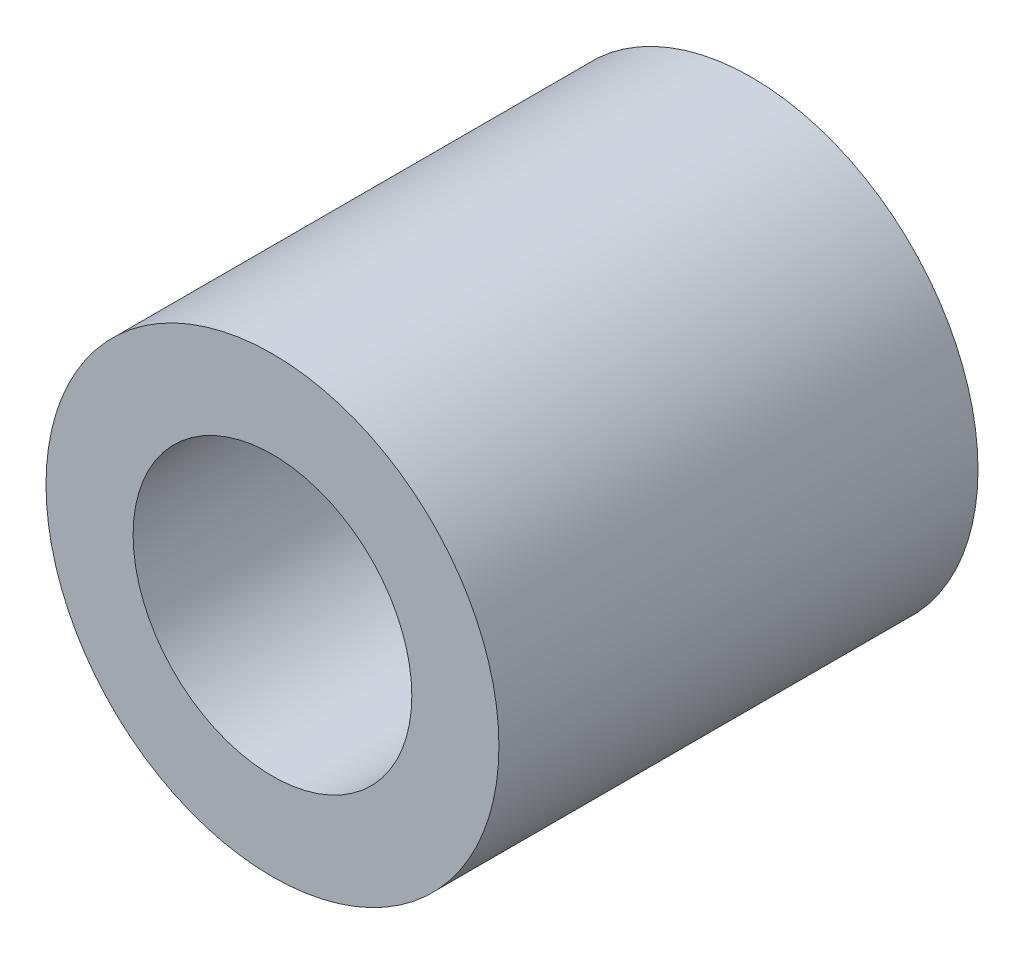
from build123d import *

# Parameters (mm, degrees)
ESQUISSE1_R      = 13
ESQUISSE1_R_2    = 8
EXTRUSION2_DEPTH = 27.5


with BuildPart() as part:
    # Esquisse1 → Extrusion2 (new body)
    with BuildSketch(Plane.XY.offset(-5)):
        with Locations((468.467875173, -125)):
            Circle(ESQUISSE1_R)
        with Locations((468.467875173, -125)):
            Circle(ESQUISSE1_R_2, mode=Mode.SUBTRACT)
    extrude(amount=-EXTRUSION2_DEPTH)


solid = part.part
